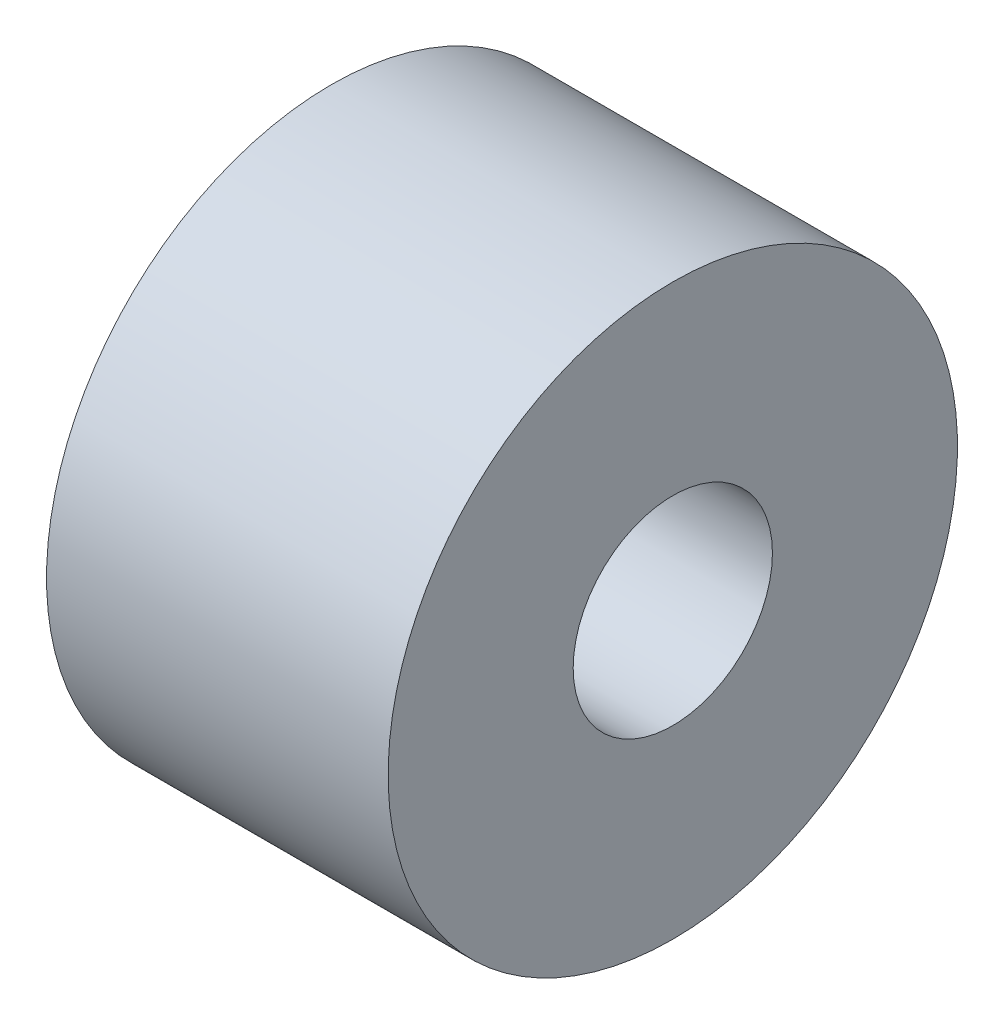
from build123d import *

# Parameters (mm, degrees)
SKETCH1_W                                           = 6
SKETCH1_H                                           = 5
CSK_FOR_M3_COUNTERSUNK_FLAT_HEAD_SCREW1_D           = 3.5
CSK_FOR_M3_COUNTERSUNK_FLAT_HEAD_SCREW1_CSINK_D     = 6.3
CSK_FOR_M3_COUNTERSUNK_FLAT_HEAD_SCREW1_CSINK_ANGLE = 90


with BuildPart() as part:
    # Sketch1 → Revolve1 (revolve)
    with BuildSketch(Plane.XY):
        with Locations((-3, 2.5)):
            Rectangle(SKETCH1_W, SKETCH1_H)
    revolve(axis=Axis((0, 0, 0), (-1, 0, 0)))

    # CSK for M3 Countersunk Flat Head Screw1 (through all)
    with Locations(Plane(origin=(-6, 0, 0), x_dir=(0, -1, 0), z_dir=(-1, 0, 0))):
        with Locations((0, 0)):
            CounterSinkHole(CSK_FOR_M3_COUNTERSUNK_FLAT_HEAD_SCREW1_D / 2, CSK_FOR_M3_COUNTERSUNK_FLAT_HEAD_SCREW1_CSINK_D / 2, counter_sink_angle=CSK_FOR_M3_COUNTERSUNK_FLAT_HEAD_SCREW1_CSINK_ANGLE)


solid = part.part
